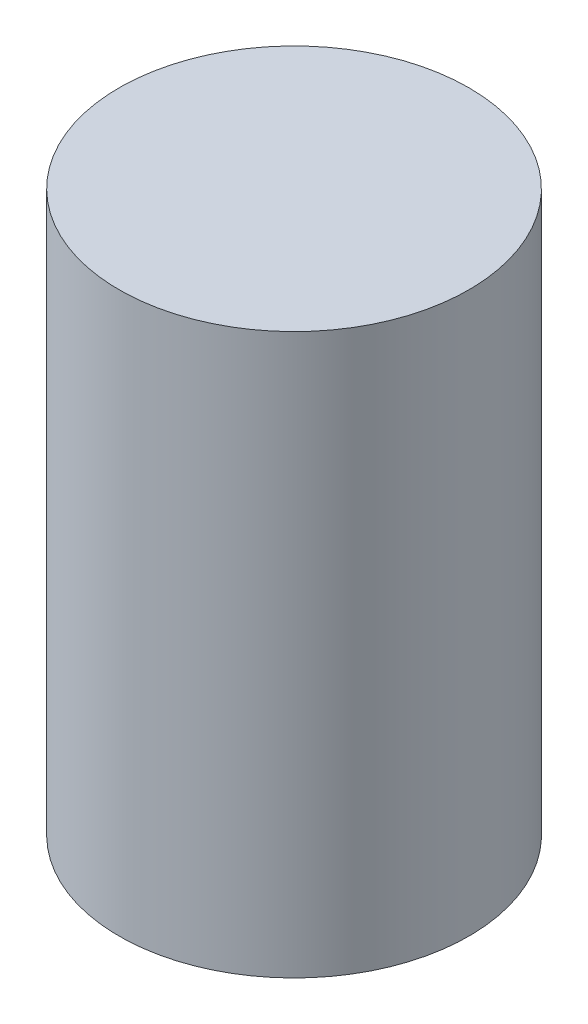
from build123d import *

# Parameters (mm, degrees)
SKETCH_1_W = 25
SKETCH_1_H = 80


with BuildPart() as part:
    # Sketch 1 → Revolve 1 (revolve)
    with BuildSketch(Plane.XY, mode=Mode.PRIVATE) as revolve_1_sk:
        with Locations((12.5, 40)):
            Rectangle(SKETCH_1_W, SKETCH_1_H)
    revolve(revolve_1_sk.sketch.rotate(Axis((0, 0, 0), (0, 1, 0)), 90), axis=Axis((0, 0, 0), (0, 1, 0)))


solid = part.part
